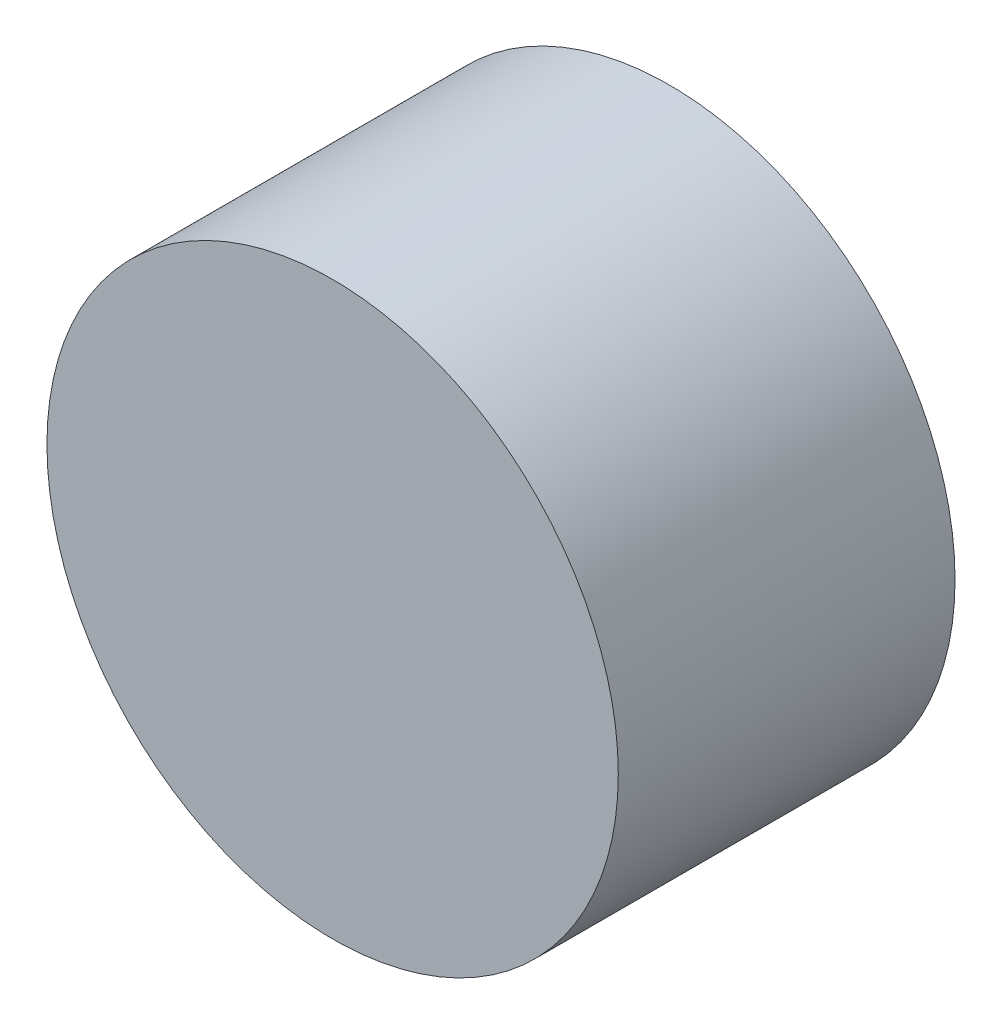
ISO-10303-21;
HEADER;
FILE_DESCRIPTION(('STEP AP214'),'2;1');
FILE_NAME('part.step','',(''),(''),'','','');
FILE_SCHEMA(('AUTOMOTIVE_DESIGN { 1 0 10303 214 1 1 1 1 }'));
ENDSEC;
DATA;
#1=APPLICATION_CONTEXT('core data for automotive mechanical design processes');
#2=APPLICATION_PROTOCOL_DEFINITION('international standard','automotive_design',2000,#1);
#3=PRODUCT_CONTEXT('',#1,'mechanical');
#4=PRODUCT('Part','Part','',(#3));
#5=PRODUCT_RELATED_PRODUCT_CATEGORY('part','',(#4));
#6=PRODUCT_DEFINITION_FORMATION('','',#4);
#7=PRODUCT_DEFINITION_CONTEXT('part definition',#1,'design');
#8=PRODUCT_DEFINITION('design','',#6,#7);
#9=PRODUCT_DEFINITION_SHAPE('','',#8);
#10=(LENGTH_UNIT() NAMED_UNIT(*) SI_UNIT(.MILLI.,.METRE.));
#11=(NAMED_UNIT(*) PLANE_ANGLE_UNIT() SI_UNIT($,.RADIAN.));
#12=(NAMED_UNIT(*) SI_UNIT($,.STERADIAN.) SOLID_ANGLE_UNIT());
#13=UNCERTAINTY_MEASURE_WITH_UNIT(LENGTH_MEASURE(1.E-05),#10,'distance_accuracy_value','');
#14=(GEOMETRIC_REPRESENTATION_CONTEXT(3) GLOBAL_UNCERTAINTY_ASSIGNED_CONTEXT((#13)) GLOBAL_UNIT_ASSIGNED_CONTEXT((#10,
#11,#12)) REPRESENTATION_CONTEXT('',''));
#15=CARTESIAN_POINT('',(0.,0.,0.));
#16=DIRECTION('',(0.,0.,1.));
#17=DIRECTION('',(1.,0.,0.));
#18=AXIS2_PLACEMENT_3D('',#15,#16,#17);
#19=CARTESIAN_POINT('',(0.,0.,1.4732));
#20=DIRECTION('',(0.,0.,-1.));
#21=DIRECTION('',(-1.,0.,0.));
#22=AXIS2_PLACEMENT_3D('',#19,#20,#21);
#23=CYLINDRICAL_SURFACE('',#22,1.24968);
#24=CARTESIAN_POINT('',(0.,0.,1.4732));
#25=DIRECTION('',(0.,0.,1.));
#26=DIRECTION('',(1.,0.,0.));
#27=AXIS2_PLACEMENT_3D('',#24,#25,#26);
#28=CIRCLE('',#27,1.24968);
#29=CARTESIAN_POINT('',(1.24968,0.,1.4732));
#30=VERTEX_POINT('',#29);
#31=EDGE_CURVE('E10',#30,#30,#28,.T.);
#32=ORIENTED_EDGE('',*,*,#31,.F.);
#33=EDGE_LOOP('',(#32));
#34=FACE_BOUND('',#33,.T.);
#35=CARTESIAN_POINT('',(0.,0.,0.));
#36=DIRECTION('',(0.,0.,1.));
#37=DIRECTION('',(1.,0.,0.));
#38=AXIS2_PLACEMENT_3D('',#35,#36,#37);
#39=CIRCLE('',#38,1.24968);
#40=CARTESIAN_POINT('',(1.24968,0.,0.));
#41=VERTEX_POINT('',#40);
#42=EDGE_CURVE('E34',#41,#41,#39,.T.);
#43=ORIENTED_EDGE('',*,*,#42,.T.);
#44=EDGE_LOOP('',(#43));
#45=FACE_BOUND('',#44,.T.);
#46=ADVANCED_FACE('F28',(#34,#45),#23,.T.);
#47=CARTESIAN_POINT('',(0.,0.,1.4732));
#48=DIRECTION('',(0.,0.,1.));
#49=DIRECTION('',(1.,0.,0.));
#50=AXIS2_PLACEMENT_3D('',#47,#48,#49);
#51=PLANE('',#50);
#52=ORIENTED_EDGE('',*,*,#31,.T.);
#53=EDGE_LOOP('',(#52));
#54=FACE_BOUND('',#53,.T.);
#55=ADVANCED_FACE('F43',(#54),#51,.T.);
#56=CARTESIAN_POINT('',(0.,0.,0.));
#57=DIRECTION('',(0.,0.,1.));
#58=DIRECTION('',(1.,0.,0.));
#59=AXIS2_PLACEMENT_3D('',#56,#57,#58);
#60=PLANE('',#59);
#61=ORIENTED_EDGE('',*,*,#42,.F.);
#62=EDGE_LOOP('',(#61));
#63=FACE_BOUND('',#62,.T.);
#64=ADVANCED_FACE('F41',(#63),#60,.F.);
#65=CLOSED_SHELL('',(#46,#55,#64));
#66=MANIFOLD_SOLID_BREP('B2',#65);
#67=ADVANCED_BREP_SHAPE_REPRESENTATION('',(#18,#66),#14);
#68=SHAPE_DEFINITION_REPRESENTATION(#9,#67);
ENDSEC;
END-ISO-10303-21;
